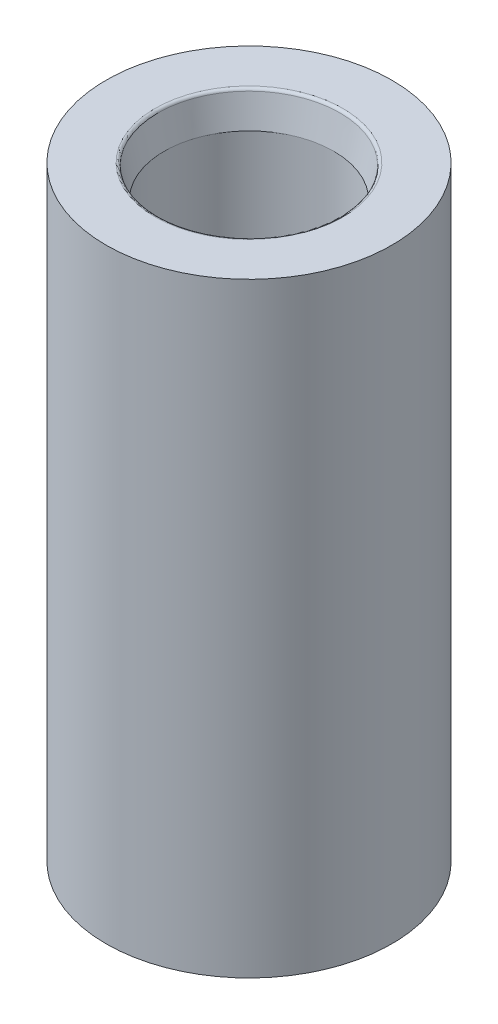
ISO-10303-21;
HEADER;
FILE_DESCRIPTION(('STEP AP214'),'2;1');
FILE_NAME('part.step','',(''),(''),'','','');
FILE_SCHEMA(('AUTOMOTIVE_DESIGN { 1 0 10303 214 1 1 1 1 }'));
ENDSEC;
DATA;
#1=APPLICATION_CONTEXT('core data for automotive mechanical design processes');
#2=APPLICATION_PROTOCOL_DEFINITION('international standard','automotive_design',2000,#1);
#3=PRODUCT_CONTEXT('',#1,'mechanical');
#4=PRODUCT('Part','Part','',(#3));
#5=PRODUCT_RELATED_PRODUCT_CATEGORY('part','',(#4));
#6=PRODUCT_DEFINITION_FORMATION('','',#4);
#7=PRODUCT_DEFINITION_CONTEXT('part definition',#1,'design');
#8=PRODUCT_DEFINITION('design','',#6,#7);
#9=PRODUCT_DEFINITION_SHAPE('','',#8);
#10=(LENGTH_UNIT() NAMED_UNIT(*) SI_UNIT(.MILLI.,.METRE.));
#11=(NAMED_UNIT(*) PLANE_ANGLE_UNIT() SI_UNIT($,.RADIAN.));
#12=(NAMED_UNIT(*) SI_UNIT($,.STERADIAN.) SOLID_ANGLE_UNIT());
#13=UNCERTAINTY_MEASURE_WITH_UNIT(LENGTH_MEASURE(1.E-05),#10,'distance_accuracy_value','');
#14=(GEOMETRIC_REPRESENTATION_CONTEXT(3) GLOBAL_UNCERTAINTY_ASSIGNED_CONTEXT((#13)) GLOBAL_UNIT_ASSIGNED_CONTEXT((#10,
#11,#12)) REPRESENTATION_CONTEXT('',''));
#15=CARTESIAN_POINT('',(0.,0.,0.));
#16=DIRECTION('',(0.,0.,1.));
#17=DIRECTION('',(1.,0.,0.));
#18=AXIS2_PLACEMENT_3D('',#15,#16,#17);
#19=CARTESIAN_POINT('',(-5.88304638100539,37.846,5.197332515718));
#20=DIRECTION('',(0.,-1.,0.));
#21=DIRECTION('',(0.,0.,-1.));
#22=AXIS2_PLACEMENT_3D('',#19,#20,#21);
#23=PLANE('',#22);
#24=CARTESIAN_POINT('',(0.,37.846,0.));
#25=DIRECTION('',(0.,1.,0.));
#26=DIRECTION('',(0.,0.,1.));
#27=AXIS2_PLACEMENT_3D('',#24,#25,#26);
#28=CIRCLE('',#27,7.85000000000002);
#29=CARTESIAN_POINT('',(0.,37.846,7.85000000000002));
#30=VERTEX_POINT('',#29);
#31=EDGE_CURVE('E59',#30,#30,#28,.T.);
#32=ORIENTED_EDGE('',*,*,#31,.F.);
#33=EDGE_LOOP('',(#32));
#34=FACE_BOUND('',#33,.T.);
#35=CARTESIAN_POINT('',(0.,37.846,0.));
#36=DIRECTION('',(0.,-1.,0.));
#37=DIRECTION('',(0.,0.,-1.));
#38=AXIS2_PLACEMENT_3D('',#35,#36,#37);
#39=CIRCLE('',#38,11.938);
#40=CARTESIAN_POINT('',(0.,37.846,-11.938));
#41=VERTEX_POINT('',#40);
#42=EDGE_CURVE('E52',#41,#41,#39,.T.);
#43=ORIENTED_EDGE('',*,*,#42,.F.);
#44=EDGE_LOOP('',(#43));
#45=FACE_BOUND('',#44,.T.);
#46=ADVANCED_FACE('F48',(#34,#45),#23,.F.);
#47=CARTESIAN_POINT('',(0.,37.592,0.));
#48=DIRECTION('',(0.,1.,0.));
#49=DIRECTION('',(0.,0.,1.));
#50=AXIS2_PLACEMENT_3D('',#47,#48,#49);
#51=TOROIDAL_SURFACE('',#50,7.85000000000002,0.254000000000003);
#52=CARTESIAN_POINT('',(0.,37.6448095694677,0.));
#53=DIRECTION('',(0.,1.,0.));
#54=DIRECTION('',(0.,0.,1.));
#55=AXIS2_PLACEMENT_3D('',#52,#53,#54);
#56=CIRCLE('',#55,7.60155050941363);
#57=CARTESIAN_POINT('',(0.,37.6448095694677,7.60155050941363));
#58=VERTEX_POINT('',#57);
#59=EDGE_CURVE('E63',#58,#58,#56,.T.);
#60=ORIENTED_EDGE('',*,*,#59,.F.);
#61=EDGE_LOOP('',(#60));
#62=FACE_BOUND('',#61,.T.);
#63=ORIENTED_EDGE('',*,*,#31,.T.);
#64=EDGE_LOOP('',(#63));
#65=FACE_BOUND('',#64,.T.);
#66=ADVANCED_FACE('F102',(#62,#65),#51,.T.);
#67=CARTESIAN_POINT('',(0.,37.6448095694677,0.));
#68=DIRECTION('',(0.,1.,0.));
#69=DIRECTION('',(0.,0.,1.));
#70=AXIS2_PLACEMENT_3D('',#67,#68,#69);
#71=CONICAL_SURFACE('',#70,7.60155050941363,0.209439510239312);
#72=CARTESIAN_POINT('',(0.,35.146,0.));
#73=DIRECTION('',(0.,1.,0.));
#74=DIRECTION('',(0.,0.,1.));
#75=AXIS2_PLACEMENT_3D('',#72,#73,#74);
#76=CIRCLE('',#75,7.07041213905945);
#77=CARTESIAN_POINT('',(0.,35.146,7.07041213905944));
#78=VERTEX_POINT('',#77);
#79=EDGE_CURVE('E66',#78,#78,#76,.T.);
#80=ORIENTED_EDGE('',*,*,#79,.F.);
#81=EDGE_LOOP('',(#80));
#82=FACE_BOUND('',#81,.T.);
#83=ORIENTED_EDGE('',*,*,#59,.T.);
#84=EDGE_LOOP('',(#83));
#85=FACE_BOUND('',#84,.T.);
#86=ADVANCED_FACE('F107',(#82,#85),#71,.F.);
#87=CARTESIAN_POINT('',(0.,35.146,0.));
#88=DIRECTION('',(0.,1.,0.));
#89=DIRECTION('',(0.,0.,1.));
#90=AXIS2_PLACEMENT_3D('',#87,#88,#89);
#91=CONICAL_SURFACE('',#90,7.07041213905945,0.785398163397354);
#92=CARTESIAN_POINT('',(0.,35.2193378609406,0.));
#93=DIRECTION('',(0.,1.,0.));
#94=DIRECTION('',(0.,0.,1.));
#95=AXIS2_PLACEMENT_3D('',#92,#93,#94);
#96=CIRCLE('',#95,7.14375000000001);
#97=CARTESIAN_POINT('',(0.,35.2193378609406,7.14375));
#98=VERTEX_POINT('',#97);
#99=EDGE_CURVE('E69',#98,#98,#96,.T.);
#100=ORIENTED_EDGE('',*,*,#99,.F.);
#101=EDGE_LOOP('',(#100));
#102=FACE_BOUND('',#101,.T.);
#103=ORIENTED_EDGE('',*,*,#79,.T.);
#104=EDGE_LOOP('',(#103));
#105=FACE_BOUND('',#104,.T.);
#106=ADVANCED_FACE('F115',(#102,#105),#91,.T.);
#107=CARTESIAN_POINT('',(0.,38.1,0.));
#108=DIRECTION('',(0.,1.,0.));
#109=DIRECTION('',(0.,0.,1.));
#110=AXIS2_PLACEMENT_3D('',#107,#108,#109);
#111=CYLINDRICAL_SURFACE('',#110,7.14375000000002);
#112=CARTESIAN_POINT('',(0.,25.146,0.));
#113=DIRECTION('',(0.,1.,0.));
#114=DIRECTION('',(0.,0.,1.));
#115=AXIS2_PLACEMENT_3D('',#112,#113,#114);
#116=CIRCLE('',#115,7.14375000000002);
#117=CARTESIAN_POINT('',(0.,25.146,7.14375000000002));
#118=VERTEX_POINT('',#117);
#119=EDGE_CURVE('E72',#118,#118,#116,.T.);
#120=ORIENTED_EDGE('',*,*,#119,.F.);
#121=EDGE_LOOP('',(#120));
#122=FACE_BOUND('',#121,.T.);
#123=ORIENTED_EDGE('',*,*,#99,.T.);
#124=EDGE_LOOP('',(#123));
#125=FACE_BOUND('',#124,.T.);
#126=ADVANCED_FACE('F119',(#122,#125),#111,.F.);
#127=CARTESIAN_POINT('',(-4.90737498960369,25.146,4.33538305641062));
#128=DIRECTION('',(0.,-1.,0.));
#129=DIRECTION('',(0.,0.,-1.));
#130=AXIS2_PLACEMENT_3D('',#127,#128,#129);
#131=PLANE('',#130);
#132=CARTESIAN_POINT('',(0.,25.146,0.));
#133=DIRECTION('',(0.,1.,0.));
#134=DIRECTION('',(0.,0.,1.));
#135=AXIS2_PLACEMENT_3D('',#132,#133,#134);
#136=CIRCLE('',#135,6.54812000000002);
#137=CARTESIAN_POINT('',(0.,25.146,6.54812000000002));
#138=VERTEX_POINT('',#137);
#139=EDGE_CURVE('E75',#138,#138,#136,.T.);
#140=ORIENTED_EDGE('',*,*,#139,.F.);
#141=EDGE_LOOP('',(#140));
#142=FACE_BOUND('',#141,.T.);
#143=ORIENTED_EDGE('',*,*,#119,.T.);
#144=EDGE_LOOP('',(#143));
#145=FACE_BOUND('',#144,.T.);
#146=ADVANCED_FACE('F123',(#142,#145),#131,.F.);
#147=CARTESIAN_POINT('',(0.,38.1,0.));
#148=DIRECTION('',(0.,1.,0.));
#149=DIRECTION('',(0.,0.,1.));
#150=AXIS2_PLACEMENT_3D('',#147,#148,#149);
#151=CYLINDRICAL_SURFACE('',#150,6.54812000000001);
#152=CARTESIAN_POINT('',(0.,6.09599999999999,0.));
#153=DIRECTION('',(0.,1.,0.));
#154=DIRECTION('',(0.,0.,1.));
#155=AXIS2_PLACEMENT_3D('',#152,#153,#154);
#156=CIRCLE('',#155,6.54812);
#157=CARTESIAN_POINT('',(0.,6.09599999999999,6.54812));
#158=VERTEX_POINT('',#157);
#159=EDGE_CURVE('E78',#158,#158,#156,.T.);
#160=ORIENTED_EDGE('',*,*,#159,.F.);
#161=EDGE_LOOP('',(#160));
#162=FACE_BOUND('',#161,.T.);
#163=ORIENTED_EDGE('',*,*,#139,.T.);
#164=EDGE_LOOP('',(#163));
#165=FACE_BOUND('',#164,.T.);
#166=ADVANCED_FACE('F127',(#162,#165),#151,.F.);
#167=CARTESIAN_POINT('',(0.,6.09599999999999,0.));
#168=DIRECTION('',(0.,1.,0.));
#169=DIRECTION('',(0.,0.,1.));
#170=AXIS2_PLACEMENT_3D('',#167,#168,#169);
#171=CONICAL_SURFACE('',#170,6.54812,1.02974425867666);
#172=CARTESIAN_POINT('',(0.,4.06922502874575,0.));
#173=DIRECTION('',(0.,1.,0.));
#174=DIRECTION('',(0.,0.,1.));
#175=AXIS2_PLACEMENT_3D('',#172,#173,#174);
#176=CIRCLE('',#175,3.175);
#177=CARTESIAN_POINT('',(0.,4.06922502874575,3.17499999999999));
#178=VERTEX_POINT('',#177);
#179=EDGE_CURVE('E81',#178,#178,#176,.F.);
#180=ORIENTED_EDGE('',*,*,#179,.T.);
#181=EDGE_LOOP('',(#180));
#182=FACE_BOUND('',#181,.T.);
#183=ORIENTED_EDGE('',*,*,#159,.T.);
#184=EDGE_LOOP('',(#183));
#185=FACE_BOUND('',#184,.T.);
#186=ADVANCED_FACE('F98',(#182,#185),#171,.F.);
#187=CARTESIAN_POINT('',(0.,-18.420388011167,0.));
#188=DIRECTION('',(0.,-1.,0.));
#189=DIRECTION('',(0.,0.,-1.));
#190=AXIS2_PLACEMENT_3D('',#187,#188,#189);
#191=CYLINDRICAL_SURFACE('',#190,11.938);
#192=ORIENTED_EDGE('',*,*,#42,.T.);
#193=EDGE_LOOP('',(#192));
#194=FACE_BOUND('',#193,.T.);
#195=CARTESIAN_POINT('',(0.,-12.7,0.));
#196=DIRECTION('',(0.,-1.,0.));
#197=DIRECTION('',(0.,0.,-1.));
#198=AXIS2_PLACEMENT_3D('',#195,#196,#197);
#199=CIRCLE('',#198,11.938);
#200=CARTESIAN_POINT('',(0.,-12.7,-11.938));
#201=VERTEX_POINT('',#200);
#202=EDGE_CURVE('E12',#201,#201,#199,.T.);
#203=ORIENTED_EDGE('',*,*,#202,.F.);
#204=EDGE_LOOP('',(#203));
#205=FACE_BOUND('',#204,.T.);
#206=ADVANCED_FACE('F50',(#194,#205),#191,.T.);
#207=CARTESIAN_POINT('',(-11.938,-12.7,0.));
#208=DIRECTION('',(0.,1.,0.));
#209=DIRECTION('',(0.,0.,1.));
#210=AXIS2_PLACEMENT_3D('',#207,#208,#209);
#211=PLANE('',#210);
#212=CARTESIAN_POINT('',(0.,-12.7,0.));
#213=DIRECTION('',(0.,-1.,0.));
#214=DIRECTION('',(0.,0.,-1.));
#215=AXIS2_PLACEMENT_3D('',#212,#213,#214);
#216=CIRCLE('',#215,3.175);
#217=CARTESIAN_POINT('',(0.,-12.7,-3.175));
#218=VERTEX_POINT('',#217);
#219=EDGE_CURVE('E84',#218,#218,#216,.T.);
#220=ORIENTED_EDGE('',*,*,#219,.F.);
#221=EDGE_LOOP('',(#220));
#222=FACE_BOUND('',#221,.T.);
#223=ORIENTED_EDGE('',*,*,#202,.T.);
#224=EDGE_LOOP('',(#223));
#225=FACE_BOUND('',#224,.T.);
#226=ADVANCED_FACE('F91',(#222,#225),#211,.F.);
#227=CARTESIAN_POINT('',(0.,37.846,0.));
#228=DIRECTION('',(0.,-1.,0.));
#229=DIRECTION('',(0.,0.,-1.));
#230=AXIS2_PLACEMENT_3D('',#227,#228,#229);
#231=CYLINDRICAL_SURFACE('',#230,3.175);
#232=ORIENTED_EDGE('',*,*,#219,.T.);
#233=EDGE_LOOP('',(#232));
#234=FACE_BOUND('',#233,.T.);
#235=ORIENTED_EDGE('',*,*,#179,.F.);
#236=EDGE_LOOP('',(#235));
#237=FACE_BOUND('',#236,.T.);
#238=ADVANCED_FACE('F88',(#234,#237),#231,.F.);
#239=CLOSED_SHELL('',(#46,#66,#86,#106,#126,#146,#166,#186,#206,#226,#238));
#240=MANIFOLD_SOLID_BREP('B2',#239);
#241=ADVANCED_BREP_SHAPE_REPRESENTATION('',(#18,#240),#14);
#242=SHAPE_DEFINITION_REPRESENTATION(#9,#241);
ENDSEC;
END-ISO-10303-21;
